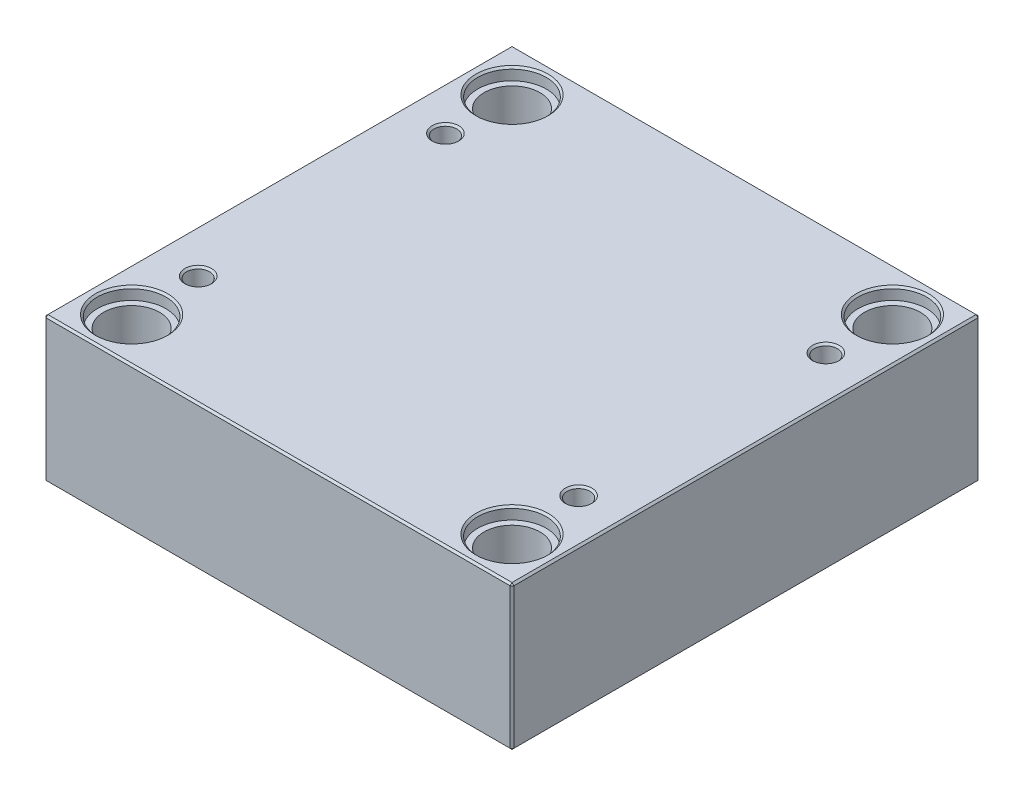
ISO-10303-21;
HEADER;
FILE_DESCRIPTION(('STEP AP214'),'2;1');
FILE_NAME('part.step','',(''),(''),'','','');
FILE_SCHEMA(('AUTOMOTIVE_DESIGN { 1 0 10303 214 1 1 1 1 }'));
ENDSEC;
DATA;
#1=APPLICATION_CONTEXT('core data for automotive mechanical design processes');
#2=APPLICATION_PROTOCOL_DEFINITION('international standard','automotive_design',2000,#1);
#3=PRODUCT_CONTEXT('',#1,'mechanical');
#4=PRODUCT('Part','Part','',(#3));
#5=PRODUCT_RELATED_PRODUCT_CATEGORY('part','',(#4));
#6=PRODUCT_DEFINITION_FORMATION('','',#4);
#7=PRODUCT_DEFINITION_CONTEXT('part definition',#1,'design');
#8=PRODUCT_DEFINITION('design','',#6,#7);
#9=PRODUCT_DEFINITION_SHAPE('','',#8);
#10=(LENGTH_UNIT() NAMED_UNIT(*) SI_UNIT(.MILLI.,.METRE.));
#11=(NAMED_UNIT(*) PLANE_ANGLE_UNIT() SI_UNIT($,.RADIAN.));
#12=(NAMED_UNIT(*) SI_UNIT($,.STERADIAN.) SOLID_ANGLE_UNIT());
#13=UNCERTAINTY_MEASURE_WITH_UNIT(LENGTH_MEASURE(1.E-05),#10,'distance_accuracy_value','');
#14=(GEOMETRIC_REPRESENTATION_CONTEXT(3) GLOBAL_UNCERTAINTY_ASSIGNED_CONTEXT((#13)) GLOBAL_UNIT_ASSIGNED_CONTEXT((#10,
#11,#12)) REPRESENTATION_CONTEXT('',''));
#15=CARTESIAN_POINT('',(0.,0.,0.));
#16=DIRECTION('',(0.,0.,1.));
#17=DIRECTION('',(1.,0.,0.));
#18=AXIS2_PLACEMENT_3D('',#15,#16,#17);
#19=CARTESIAN_POINT('',(-100.,0.,-100.));
#20=DIRECTION('',(0.,1.,0.));
#21=DIRECTION('',(0.,0.,1.));
#22=AXIS2_PLACEMENT_3D('',#19,#20,#21);
#23=CYLINDRICAL_SURFACE('',#22,14.7);
#24=CARTESIAN_POINT('',(-100.,0.999999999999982,-100.));
#25=DIRECTION('',(0.,1.,0.));
#26=DIRECTION('',(0.,0.,1.));
#27=AXIS2_PLACEMENT_3D('',#24,#25,#26);
#28=CIRCLE('',#27,14.7);
#29=CARTESIAN_POINT('',(-100.,0.999999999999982,-85.3));
#30=VERTEX_POINT('',#29);
#31=EDGE_CURVE('E472',#30,#30,#28,.F.);
#32=ORIENTED_EDGE('',*,*,#31,.T.);
#33=EDGE_LOOP('',(#32));
#34=FACE_BOUND('',#33,.T.);
#35=CARTESIAN_POINT('',(-100.,69.7,-100.));
#36=DIRECTION('',(0.,1.,0.));
#37=DIRECTION('',(0.,0.,1.));
#38=AXIS2_PLACEMENT_3D('',#35,#36,#37);
#39=CIRCLE('',#38,14.7);
#40=CARTESIAN_POINT('',(-100.,69.7,-85.3));
#41=VERTEX_POINT('',#40);
#42=EDGE_CURVE('E221',#41,#41,#39,.F.);
#43=ORIENTED_EDGE('',*,*,#42,.F.);
#44=EDGE_LOOP('',(#43));
#45=FACE_BOUND('',#44,.T.);
#46=ADVANCED_FACE('F16',(#34,#45),#23,.F.);
#47=CARTESIAN_POINT('',(100.,0.,-100.));
#48=DIRECTION('',(0.,1.,0.));
#49=DIRECTION('',(0.,0.,1.));
#50=AXIS2_PLACEMENT_3D('',#47,#48,#49);
#51=CYLINDRICAL_SURFACE('',#50,14.7);
#52=CARTESIAN_POINT('',(100.,0.999999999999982,-100.));
#53=DIRECTION('',(0.,1.,0.));
#54=DIRECTION('',(0.,0.,1.));
#55=AXIS2_PLACEMENT_3D('',#52,#53,#54);
#56=CIRCLE('',#55,14.7);
#57=CARTESIAN_POINT('',(100.,0.999999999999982,-85.3));
#58=VERTEX_POINT('',#57);
#59=EDGE_CURVE('E474',#58,#58,#56,.F.);
#60=ORIENTED_EDGE('',*,*,#59,.T.);
#61=EDGE_LOOP('',(#60));
#62=FACE_BOUND('',#61,.T.);
#63=CARTESIAN_POINT('',(100.,69.7,-100.));
#64=DIRECTION('',(0.,1.,0.));
#65=DIRECTION('',(0.,0.,1.));
#66=AXIS2_PLACEMENT_3D('',#63,#64,#65);
#67=CIRCLE('',#66,14.7);
#68=CARTESIAN_POINT('',(100.,69.7,-85.3));
#69=VERTEX_POINT('',#68);
#70=EDGE_CURVE('E218',#69,#69,#67,.F.);
#71=ORIENTED_EDGE('',*,*,#70,.F.);
#72=EDGE_LOOP('',(#71));
#73=FACE_BOUND('',#72,.T.);
#74=ADVANCED_FACE('F263',(#62,#73),#51,.F.);
#75=CARTESIAN_POINT('',(100.,0.,100.));
#76=DIRECTION('',(0.,1.,0.));
#77=DIRECTION('',(0.,0.,1.));
#78=AXIS2_PLACEMENT_3D('',#75,#76,#77);
#79=CYLINDRICAL_SURFACE('',#78,14.7);
#80=CARTESIAN_POINT('',(100.,1.00000000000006,100.));
#81=DIRECTION('',(0.,1.,0.));
#82=DIRECTION('',(0.,0.,1.));
#83=AXIS2_PLACEMENT_3D('',#80,#81,#82);
#84=CIRCLE('',#83,14.7);
#85=CARTESIAN_POINT('',(100.,1.00000000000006,114.7));
#86=VERTEX_POINT('',#85);
#87=EDGE_CURVE('E477',#86,#86,#84,.F.);
#88=ORIENTED_EDGE('',*,*,#87,.T.);
#89=EDGE_LOOP('',(#88));
#90=FACE_BOUND('',#89,.T.);
#91=CARTESIAN_POINT('',(100.,69.7,100.));
#92=DIRECTION('',(0.,1.,0.));
#93=DIRECTION('',(0.,0.,1.));
#94=AXIS2_PLACEMENT_3D('',#91,#92,#93);
#95=CIRCLE('',#94,14.7);
#96=CARTESIAN_POINT('',(100.,69.7,114.7));
#97=VERTEX_POINT('',#96);
#98=EDGE_CURVE('E214',#97,#97,#95,.F.);
#99=ORIENTED_EDGE('',*,*,#98,.F.);
#100=EDGE_LOOP('',(#99));
#101=FACE_BOUND('',#100,.T.);
#102=ADVANCED_FACE('F270',(#90,#101),#79,.F.);
#103=CARTESIAN_POINT('',(-100.,0.,100.));
#104=DIRECTION('',(0.,1.,0.));
#105=DIRECTION('',(0.,0.,1.));
#106=AXIS2_PLACEMENT_3D('',#103,#104,#105);
#107=CYLINDRICAL_SURFACE('',#106,14.7);
#108=CARTESIAN_POINT('',(-100.,0.999999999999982,100.));
#109=DIRECTION('',(0.,1.,0.));
#110=DIRECTION('',(0.,0.,1.));
#111=AXIS2_PLACEMENT_3D('',#108,#109,#110);
#112=CIRCLE('',#111,14.7);
#113=CARTESIAN_POINT('',(-100.,0.999999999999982,114.7));
#114=VERTEX_POINT('',#113);
#115=EDGE_CURVE('E480',#114,#114,#112,.F.);
#116=ORIENTED_EDGE('',*,*,#115,.T.);
#117=EDGE_LOOP('',(#116));
#118=FACE_BOUND('',#117,.T.);
#119=CARTESIAN_POINT('',(-100.,69.7,100.));
#120=DIRECTION('',(0.,1.,0.));
#121=DIRECTION('',(0.,0.,1.));
#122=AXIS2_PLACEMENT_3D('',#119,#120,#121);
#123=CIRCLE('',#122,14.7);
#124=CARTESIAN_POINT('',(-100.,69.7,114.7));
#125=VERTEX_POINT('',#124);
#126=EDGE_CURVE('E211',#125,#125,#123,.F.);
#127=ORIENTED_EDGE('',*,*,#126,.F.);
#128=EDGE_LOOP('',(#127));
#129=FACE_BOUND('',#128,.T.);
#130=ADVANCED_FACE('F277',(#118,#129),#107,.F.);
#131=CARTESIAN_POINT('',(-123.,76.,123.));
#132=DIRECTION('',(1.,0.,0.));
#133=DIRECTION('',(0.,0.,-1.));
#134=AXIS2_PLACEMENT_3D('',#131,#132,#133);
#135=PLANE('',#134);
#136=DIRECTION('',(0.,-1.,0.));
#137=VECTOR('',#136,1.);
#138=CARTESIAN_POINT('',(-123.,76.,-122.));
#139=LINE('',#138,#137);
#140=CARTESIAN_POINT('',(-123.,75.,-122.));
#141=VERTEX_POINT('',#140);
#142=CARTESIAN_POINT('',(-123.,1.00000000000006,-122.));
#143=VERTEX_POINT('',#142);
#144=EDGE_CURVE('E487',#141,#143,#139,.T.);
#145=ORIENTED_EDGE('',*,*,#144,.T.);
#146=DIRECTION('',(0.,0.,1.));
#147=VECTOR('',#146,1.);
#148=CARTESIAN_POINT('',(-123.,1.00000000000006,123.));
#149=LINE('',#148,#147);
#150=CARTESIAN_POINT('',(-123.,1.00000000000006,122.));
#151=VERTEX_POINT('',#150);
#152=EDGE_CURVE('E490',#143,#151,#149,.T.);
#153=ORIENTED_EDGE('',*,*,#152,.T.);
#154=DIRECTION('',(0.,1.,0.));
#155=VECTOR('',#154,1.);
#156=CARTESIAN_POINT('',(-123.,76.,122.));
#157=LINE('',#156,#155);
#158=CARTESIAN_POINT('',(-123.,75.,122.));
#159=VERTEX_POINT('',#158);
#160=EDGE_CURVE('E485',#151,#159,#157,.T.);
#161=ORIENTED_EDGE('',*,*,#160,.T.);
#162=DIRECTION('',(0.,0.,-1.));
#163=VECTOR('',#162,1.);
#164=CARTESIAN_POINT('',(-123.,75.,-123.));
#165=LINE('',#164,#163);
#166=EDGE_CURVE('E483',#159,#141,#165,.T.);
#167=ORIENTED_EDGE('',*,*,#166,.T.);
#168=EDGE_LOOP('',(#145,#153,#161,#167));
#169=FACE_BOUND('',#168,.T.);
#170=ADVANCED_FACE('F298',(#169),#135,.F.);
#171=CARTESIAN_POINT('',(123.,76.,123.));
#172=DIRECTION('',(0.,0.,-1.));
#173=DIRECTION('',(-1.,0.,0.));
#174=AXIS2_PLACEMENT_3D('',#171,#172,#173);
#175=PLANE('',#174);
#176=DIRECTION('',(-1.,0.,0.));
#177=VECTOR('',#176,1.);
#178=CARTESIAN_POINT('',(-123.,75.,123.));
#179=LINE('',#178,#177);
#180=CARTESIAN_POINT('',(122.,75.,123.));
#181=VERTEX_POINT('',#180);
#182=CARTESIAN_POINT('',(-122.,75.,123.));
#183=VERTEX_POINT('',#182);
#184=EDGE_CURVE('E509',#181,#183,#179,.T.);
#185=ORIENTED_EDGE('',*,*,#184,.T.);
#186=DIRECTION('',(0.,-1.,0.));
#187=VECTOR('',#186,1.);
#188=CARTESIAN_POINT('',(-122.,76.,123.));
#189=LINE('',#188,#187);
#190=CARTESIAN_POINT('',(-122.,1.,123.));
#191=VERTEX_POINT('',#190);
#192=EDGE_CURVE('E515',#183,#191,#189,.T.);
#193=ORIENTED_EDGE('',*,*,#192,.T.);
#194=DIRECTION('',(1.,0.,0.));
#195=VECTOR('',#194,1.);
#196=CARTESIAN_POINT('',(123.,1.,123.));
#197=LINE('',#196,#195);
#198=CARTESIAN_POINT('',(122.,1.,123.));
#199=VERTEX_POINT('',#198);
#200=EDGE_CURVE('E513',#191,#199,#197,.T.);
#201=ORIENTED_EDGE('',*,*,#200,.T.);
#202=DIRECTION('',(0.,1.,0.));
#203=VECTOR('',#202,1.);
#204=CARTESIAN_POINT('',(122.,76.,123.));
#205=LINE('',#204,#203);
#206=EDGE_CURVE('E511',#199,#181,#205,.T.);
#207=ORIENTED_EDGE('',*,*,#206,.T.);
#208=EDGE_LOOP('',(#185,#193,#201,#207));
#209=FACE_BOUND('',#208,.T.);
#210=ADVANCED_FACE('F294',(#209),#175,.F.);
#211=CARTESIAN_POINT('',(123.,76.,123.));
#212=DIRECTION('',(-1.,0.,0.));
#213=DIRECTION('',(0.,0.,1.));
#214=AXIS2_PLACEMENT_3D('',#211,#212,#213);
#215=PLANE('',#214);
#216=DIRECTION('',(0.,0.,-1.));
#217=VECTOR('',#216,1.);
#218=CARTESIAN_POINT('',(123.,1.,123.));
#219=LINE('',#218,#217);
#220=CARTESIAN_POINT('',(123.,1.,122.));
#221=VERTEX_POINT('',#220);
#222=CARTESIAN_POINT('',(123.,1.,-122.));
#223=VERTEX_POINT('',#222);
#224=EDGE_CURVE('E504',#221,#223,#219,.T.);
#225=ORIENTED_EDGE('',*,*,#224,.T.);
#226=DIRECTION('',(0.,1.,0.));
#227=VECTOR('',#226,1.);
#228=CARTESIAN_POINT('',(123.,76.,-122.));
#229=LINE('',#228,#227);
#230=CARTESIAN_POINT('',(123.,75.,-122.));
#231=VERTEX_POINT('',#230);
#232=EDGE_CURVE('E506',#223,#231,#229,.T.);
#233=ORIENTED_EDGE('',*,*,#232,.T.);
#234=DIRECTION('',(0.,0.,1.));
#235=VECTOR('',#234,1.);
#236=CARTESIAN_POINT('',(123.,75.,123.));
#237=LINE('',#236,#235);
#238=CARTESIAN_POINT('',(123.,75.,122.));
#239=VERTEX_POINT('',#238);
#240=EDGE_CURVE('E500',#231,#239,#237,.T.);
#241=ORIENTED_EDGE('',*,*,#240,.T.);
#242=DIRECTION('',(0.,-1.,0.));
#243=VECTOR('',#242,1.);
#244=CARTESIAN_POINT('',(123.,76.,122.));
#245=LINE('',#244,#243);
#246=EDGE_CURVE('E502',#239,#221,#245,.T.);
#247=ORIENTED_EDGE('',*,*,#246,.T.);
#248=EDGE_LOOP('',(#225,#233,#241,#247));
#249=FACE_BOUND('',#248,.T.);
#250=ADVANCED_FACE('F290',(#249),#215,.F.);
#251=CARTESIAN_POINT('',(123.,76.,-123.));
#252=DIRECTION('',(0.,0.,1.));
#253=DIRECTION('',(1.,0.,0.));
#254=AXIS2_PLACEMENT_3D('',#251,#252,#253);
#255=PLANE('',#254);
#256=DIRECTION('',(0.,-1.,0.));
#257=VECTOR('',#256,1.);
#258=CARTESIAN_POINT('',(122.,76.,-123.));
#259=LINE('',#258,#257);
#260=CARTESIAN_POINT('',(122.,75.,-123.));
#261=VERTEX_POINT('',#260);
#262=CARTESIAN_POINT('',(122.,1.,-123.));
#263=VERTEX_POINT('',#262);
#264=EDGE_CURVE('E494',#261,#263,#259,.T.);
#265=ORIENTED_EDGE('',*,*,#264,.T.);
#266=DIRECTION('',(-1.,0.,0.));
#267=VECTOR('',#266,1.);
#268=CARTESIAN_POINT('',(123.,1.,-123.));
#269=LINE('',#268,#267);
#270=CARTESIAN_POINT('',(-122.,1.,-123.));
#271=VERTEX_POINT('',#270);
#272=EDGE_CURVE('E138',#263,#271,#269,.T.);
#273=ORIENTED_EDGE('',*,*,#272,.T.);
#274=DIRECTION('',(0.,1.,0.));
#275=VECTOR('',#274,1.);
#276=CARTESIAN_POINT('',(-122.,76.,-123.));
#277=LINE('',#276,#275);
#278=CARTESIAN_POINT('',(-122.,75.,-123.));
#279=VERTEX_POINT('',#278);
#280=EDGE_CURVE('E496',#271,#279,#277,.T.);
#281=ORIENTED_EDGE('',*,*,#280,.T.);
#282=DIRECTION('',(1.,0.,0.));
#283=VECTOR('',#282,1.);
#284=CARTESIAN_POINT('',(123.,75.,-123.));
#285=LINE('',#284,#283);
#286=EDGE_CURVE('E492',#279,#261,#285,.T.);
#287=ORIENTED_EDGE('',*,*,#286,.T.);
#288=EDGE_LOOP('',(#265,#273,#281,#287));
#289=FACE_BOUND('',#288,.T.);
#290=ADVANCED_FACE('F282',(#289),#255,.F.);
#291=CARTESIAN_POINT('',(0.,76.,0.));
#292=DIRECTION('',(0.,1.,0.));
#293=DIRECTION('',(0.,0.,1.));
#294=AXIS2_PLACEMENT_3D('',#291,#292,#293);
#295=PLANE('',#294);
#296=CARTESIAN_POINT('',(100.,76.,100.));
#297=DIRECTION('',(0.,1.,0.));
#298=DIRECTION('',(0.,0.,1.));
#299=AXIS2_PLACEMENT_3D('',#296,#297,#298);
#300=CIRCLE('',#299,19.);
#301=CARTESIAN_POINT('',(100.,76.,119.));
#302=VERTEX_POINT('',#301);
#303=EDGE_CURVE('E236',#302,#302,#300,.F.);
#304=ORIENTED_EDGE('',*,*,#303,.T.);
#305=EDGE_LOOP('',(#304));
#306=FACE_BOUND('',#305,.T.);
#307=CARTESIAN_POINT('',(-100.,76.,100.));
#308=DIRECTION('',(0.,1.,0.));
#309=DIRECTION('',(0.,0.,1.));
#310=AXIS2_PLACEMENT_3D('',#307,#308,#309);
#311=CIRCLE('',#310,19.);
#312=CARTESIAN_POINT('',(-100.,76.,119.));
#313=VERTEX_POINT('',#312);
#314=EDGE_CURVE('E233',#313,#313,#311,.F.);
#315=ORIENTED_EDGE('',*,*,#314,.T.);
#316=EDGE_LOOP('',(#315));
#317=FACE_BOUND('',#316,.T.);
#318=CARTESIAN_POINT('',(100.,76.,-100.));
#319=DIRECTION('',(0.,1.,0.));
#320=DIRECTION('',(0.,0.,1.));
#321=AXIS2_PLACEMENT_3D('',#318,#319,#320);
#322=CIRCLE('',#321,19.);
#323=CARTESIAN_POINT('',(100.,76.,-81.));
#324=VERTEX_POINT('',#323);
#325=EDGE_CURVE('E230',#324,#324,#322,.F.);
#326=ORIENTED_EDGE('',*,*,#325,.T.);
#327=EDGE_LOOP('',(#326));
#328=FACE_BOUND('',#327,.T.);
#329=CARTESIAN_POINT('',(-100.,76.,-100.));
#330=DIRECTION('',(0.,1.,0.));
#331=DIRECTION('',(0.,0.,1.));
#332=AXIS2_PLACEMENT_3D('',#329,#330,#331);
#333=CIRCLE('',#332,19.);
#334=CARTESIAN_POINT('',(-100.,76.,-81.));
#335=VERTEX_POINT('',#334);
#336=EDGE_CURVE('E227',#335,#335,#333,.F.);
#337=ORIENTED_EDGE('',*,*,#336,.T.);
#338=EDGE_LOOP('',(#337));
#339=FACE_BOUND('',#338,.T.);
#340=CARTESIAN_POINT('',(-100.,76.,65.));
#341=DIRECTION('',(0.,1.,0.));
#342=DIRECTION('',(0.,0.,1.));
#343=AXIS2_PLACEMENT_3D('',#340,#341,#342);
#344=CIRCLE('',#343,7.);
#345=CARTESIAN_POINT('',(-100.,76.,72.));
#346=VERTEX_POINT('',#345);
#347=EDGE_CURVE('E198',#346,#346,#344,.F.);
#348=ORIENTED_EDGE('',*,*,#347,.T.);
#349=EDGE_LOOP('',(#348));
#350=FACE_BOUND('',#349,.T.);
#351=CARTESIAN_POINT('',(100.,76.,65.));
#352=DIRECTION('',(0.,1.,0.));
#353=DIRECTION('',(0.,0.,1.));
#354=AXIS2_PLACEMENT_3D('',#351,#352,#353);
#355=CIRCLE('',#354,7.);
#356=CARTESIAN_POINT('',(100.,76.,72.));
#357=VERTEX_POINT('',#356);
#358=EDGE_CURVE('E195',#357,#357,#355,.F.);
#359=ORIENTED_EDGE('',*,*,#358,.T.);
#360=EDGE_LOOP('',(#359));
#361=FACE_BOUND('',#360,.T.);
#362=CARTESIAN_POINT('',(100.,76.,-65.));
#363=DIRECTION('',(0.,1.,0.));
#364=DIRECTION('',(0.,0.,1.));
#365=AXIS2_PLACEMENT_3D('',#362,#363,#364);
#366=CIRCLE('',#365,7.);
#367=CARTESIAN_POINT('',(100.,76.,-58.));
#368=VERTEX_POINT('',#367);
#369=EDGE_CURVE('E192',#368,#368,#366,.F.);
#370=ORIENTED_EDGE('',*,*,#369,.T.);
#371=EDGE_LOOP('',(#370));
#372=FACE_BOUND('',#371,.T.);
#373=CARTESIAN_POINT('',(-100.,76.,-65.));
#374=DIRECTION('',(0.,1.,0.));
#375=DIRECTION('',(0.,0.,1.));
#376=AXIS2_PLACEMENT_3D('',#373,#374,#375);
#377=CIRCLE('',#376,7.00000000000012);
#378=CARTESIAN_POINT('',(-100.,76.,-57.9999999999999));
#379=VERTEX_POINT('',#378);
#380=EDGE_CURVE('E188',#379,#379,#377,.F.);
#381=ORIENTED_EDGE('',*,*,#380,.T.);
#382=EDGE_LOOP('',(#381));
#383=FACE_BOUND('',#382,.T.);
#384=DIRECTION('',(0.,0.,-1.));
#385=VECTOR('',#384,1.);
#386=CARTESIAN_POINT('',(122.,76.,-123.));
#387=LINE('',#386,#385);
#388=CARTESIAN_POINT('',(122.,76.,122.));
#389=VERTEX_POINT('',#388);
#390=CARTESIAN_POINT('',(122.,76.,-122.));
#391=VERTEX_POINT('',#390);
#392=EDGE_CURVE('E31',#389,#391,#387,.T.);
#393=ORIENTED_EDGE('',*,*,#392,.T.);
#394=DIRECTION('',(-1.,0.,0.));
#395=VECTOR('',#394,1.);
#396=CARTESIAN_POINT('',(-123.,76.,-122.));
#397=LINE('',#396,#395);
#398=CARTESIAN_POINT('',(-122.,76.,-122.));
#399=VERTEX_POINT('',#398);
#400=EDGE_CURVE('E189',#391,#399,#397,.T.);
#401=ORIENTED_EDGE('',*,*,#400,.T.);
#402=DIRECTION('',(0.,0.,1.));
#403=VECTOR('',#402,1.);
#404=CARTESIAN_POINT('',(-122.,76.,123.));
#405=LINE('',#404,#403);
#406=CARTESIAN_POINT('',(-122.,76.,122.));
#407=VERTEX_POINT('',#406);
#408=EDGE_CURVE('E518',#399,#407,#405,.T.);
#409=ORIENTED_EDGE('',*,*,#408,.T.);
#410=DIRECTION('',(1.,0.,0.));
#411=VECTOR('',#410,1.);
#412=CARTESIAN_POINT('',(123.,76.,122.));
#413=LINE('',#412,#411);
#414=EDGE_CURVE('E36',#407,#389,#413,.T.);
#415=ORIENTED_EDGE('',*,*,#414,.T.);
#416=EDGE_LOOP('',(#393,#401,#409,#415));
#417=FACE_BOUND('',#416,.T.);
#418=ADVANCED_FACE('F279',(#306,#317,#328,#339,#350,#361,#372,#383,#417),#295,.T.);
#419=CARTESIAN_POINT('',(0.,0.,0.));
#420=DIRECTION('',(0.,1.,0.));
#421=DIRECTION('',(0.,0.,1.));
#422=AXIS2_PLACEMENT_3D('',#419,#420,#421);
#423=PLANE('',#422);
#424=CARTESIAN_POINT('',(-100.,0.,-100.));
#425=DIRECTION('',(0.,1.,0.));
#426=DIRECTION('',(0.,0.,1.));
#427=AXIS2_PLACEMENT_3D('',#424,#425,#426);
#428=CIRCLE('',#427,15.7);
#429=CARTESIAN_POINT('',(-100.,0.,-84.3));
#430=VERTEX_POINT('',#429);
#431=EDGE_CURVE('E469',#430,#430,#428,.T.);
#432=ORIENTED_EDGE('',*,*,#431,.T.);
#433=EDGE_LOOP('',(#432));
#434=FACE_BOUND('',#433,.T.);
#435=CARTESIAN_POINT('',(100.,0.,-100.));
#436=DIRECTION('',(0.,1.,0.));
#437=DIRECTION('',(0.,0.,1.));
#438=AXIS2_PLACEMENT_3D('',#435,#436,#437);
#439=CIRCLE('',#438,15.7);
#440=CARTESIAN_POINT('',(100.,0.,-84.3));
#441=VERTEX_POINT('',#440);
#442=EDGE_CURVE('E466',#441,#441,#439,.T.);
#443=ORIENTED_EDGE('',*,*,#442,.T.);
#444=EDGE_LOOP('',(#443));
#445=FACE_BOUND('',#444,.T.);
#446=CARTESIAN_POINT('',(100.,0.,100.));
#447=DIRECTION('',(0.,1.,0.));
#448=DIRECTION('',(0.,0.,1.));
#449=AXIS2_PLACEMENT_3D('',#446,#447,#448);
#450=CIRCLE('',#449,15.7);
#451=CARTESIAN_POINT('',(100.,0.,115.7));
#452=VERTEX_POINT('',#451);
#453=EDGE_CURVE('E463',#452,#452,#450,.T.);
#454=ORIENTED_EDGE('',*,*,#453,.T.);
#455=EDGE_LOOP('',(#454));
#456=FACE_BOUND('',#455,.T.);
#457=CARTESIAN_POINT('',(-100.,0.,100.));
#458=DIRECTION('',(0.,1.,0.));
#459=DIRECTION('',(0.,0.,1.));
#460=AXIS2_PLACEMENT_3D('',#457,#458,#459);
#461=CIRCLE('',#460,15.7);
#462=CARTESIAN_POINT('',(-100.,0.,115.7));
#463=VERTEX_POINT('',#462);
#464=EDGE_CURVE('E460',#463,#463,#461,.T.);
#465=ORIENTED_EDGE('',*,*,#464,.T.);
#466=EDGE_LOOP('',(#465));
#467=FACE_BOUND('',#466,.T.);
#468=DIRECTION('',(0.,0.,1.));
#469=VECTOR('',#468,1.);
#470=CARTESIAN_POINT('',(122.,0.,0.));
#471=LINE('',#470,#469);
#472=CARTESIAN_POINT('',(122.,0.,-122.));
#473=VERTEX_POINT('',#472);
#474=CARTESIAN_POINT('',(122.,0.,122.));
#475=VERTEX_POINT('',#474);
#476=EDGE_CURVE('E108',#473,#475,#471,.T.);
#477=ORIENTED_EDGE('',*,*,#476,.T.);
#478=DIRECTION('',(-1.,0.,0.));
#479=VECTOR('',#478,1.);
#480=CARTESIAN_POINT('',(0.,0.,122.));
#481=LINE('',#480,#479);
#482=CARTESIAN_POINT('',(-122.,0.,122.));
#483=VERTEX_POINT('',#482);
#484=EDGE_CURVE('E458',#475,#483,#481,.T.);
#485=ORIENTED_EDGE('',*,*,#484,.T.);
#486=DIRECTION('',(0.,0.,-1.));
#487=VECTOR('',#486,1.);
#488=CARTESIAN_POINT('',(-122.,0.,0.));
#489=LINE('',#488,#487);
#490=CARTESIAN_POINT('',(-122.,0.,-122.));
#491=VERTEX_POINT('',#490);
#492=EDGE_CURVE('E110',#483,#491,#489,.T.);
#493=ORIENTED_EDGE('',*,*,#492,.T.);
#494=DIRECTION('',(1.,0.,0.));
#495=VECTOR('',#494,1.);
#496=CARTESIAN_POINT('',(0.,0.,-122.));
#497=LINE('',#496,#495);
#498=EDGE_CURVE('E104',#491,#473,#497,.T.);
#499=ORIENTED_EDGE('',*,*,#498,.T.);
#500=EDGE_LOOP('',(#477,#485,#493,#499));
#501=FACE_BOUND('',#500,.T.);
#502=ADVANCED_FACE('F106',(#434,#445,#456,#467,#501),#423,.F.);
#503=CARTESIAN_POINT('',(-100.,0.,-100.));
#504=DIRECTION('',(0.,-1.,0.));
#505=DIRECTION('',(0.,0.,-1.));
#506=AXIS2_PLACEMENT_3D('',#503,#504,#505);
#507=CONICAL_SURFACE('',#506,15.7,0.785398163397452);
#508=ORIENTED_EDGE('',*,*,#31,.F.);
#509=EDGE_LOOP('',(#508));
#510=FACE_BOUND('',#509,.T.);
#511=ORIENTED_EDGE('',*,*,#431,.F.);
#512=EDGE_LOOP('',(#511));
#513=FACE_BOUND('',#512,.T.);
#514=ADVANCED_FACE('F286',(#510,#513),#507,.F.);
#515=CARTESIAN_POINT('',(100.,0.,-100.));
#516=DIRECTION('',(0.,-1.,0.));
#517=DIRECTION('',(0.,0.,-1.));
#518=AXIS2_PLACEMENT_3D('',#515,#516,#517);
#519=CONICAL_SURFACE('',#518,15.7,0.785398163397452);
#520=ORIENTED_EDGE('',*,*,#59,.F.);
#521=EDGE_LOOP('',(#520));
#522=FACE_BOUND('',#521,.T.);
#523=ORIENTED_EDGE('',*,*,#442,.F.);
#524=EDGE_LOOP('',(#523));
#525=FACE_BOUND('',#524,.T.);
#526=ADVANCED_FACE('F305',(#522,#525),#519,.F.);
#527=CARTESIAN_POINT('',(100.,0.,100.));
#528=DIRECTION('',(0.,-1.,0.));
#529=DIRECTION('',(0.,0.,-1.));
#530=AXIS2_PLACEMENT_3D('',#527,#528,#529);
#531=CONICAL_SURFACE('',#530,15.7,0.785398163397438);
#532=ORIENTED_EDGE('',*,*,#87,.F.);
#533=EDGE_LOOP('',(#532));
#534=FACE_BOUND('',#533,.T.);
#535=ORIENTED_EDGE('',*,*,#453,.F.);
#536=EDGE_LOOP('',(#535));
#537=FACE_BOUND('',#536,.T.);
#538=ADVANCED_FACE('F309',(#534,#537),#531,.F.);
#539=CARTESIAN_POINT('',(-100.,0.,100.));
#540=DIRECTION('',(0.,-1.,0.));
#541=DIRECTION('',(0.,0.,-1.));
#542=AXIS2_PLACEMENT_3D('',#539,#540,#541);
#543=CONICAL_SURFACE('',#542,15.7,0.785398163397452);
#544=ORIENTED_EDGE('',*,*,#115,.F.);
#545=EDGE_LOOP('',(#544));
#546=FACE_BOUND('',#545,.T.);
#547=ORIENTED_EDGE('',*,*,#464,.F.);
#548=EDGE_LOOP('',(#547));
#549=FACE_BOUND('',#548,.T.);
#550=ADVANCED_FACE('F313',(#546,#549),#543,.F.);
#551=CARTESIAN_POINT('',(123.,76.,122.));
#552=DIRECTION('',(-0.707106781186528,0.,-0.707106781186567));
#553=DIRECTION('',(0.,-1.,0.));
#554=AXIS2_PLACEMENT_3D('',#551,#552,#553);
#555=PLANE('',#554);
#556=DIRECTION('',(-0.707106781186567,0.,0.707106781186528));
#557=VECTOR('',#556,1.);
#558=CARTESIAN_POINT('',(122.,75.,123.));
#559=LINE('',#558,#557);
#560=EDGE_CURVE('E126',#181,#239,#559,.F.);
#561=ORIENTED_EDGE('',*,*,#560,.F.);
#562=ORIENTED_EDGE('',*,*,#206,.F.);
#563=DIRECTION('',(0.707106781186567,0.,-0.707106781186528));
#564=VECTOR('',#563,1.);
#565=CARTESIAN_POINT('',(122.,1.,123.));
#566=LINE('',#565,#564);
#567=EDGE_CURVE('E180',#221,#199,#566,.F.);
#568=ORIENTED_EDGE('',*,*,#567,.F.);
#569=ORIENTED_EDGE('',*,*,#246,.F.);
#570=EDGE_LOOP('',(#561,#562,#568,#569));
#571=FACE_BOUND('',#570,.T.);
#572=ADVANCED_FACE('F317',(#571),#555,.F.);
#573=CARTESIAN_POINT('',(122.,75.,123.));
#574=DIRECTION('',(0.577350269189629,0.577350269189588,0.577350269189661));
#575=DIRECTION('',(0.707106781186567,0.,-0.707106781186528));
#576=AXIS2_PLACEMENT_3D('',#573,#574,#575);
#577=PLANE('',#576);
#578=DIRECTION('',(0.,-0.70710678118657,0.707106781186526));
#579=VECTOR('',#578,1.);
#580=CARTESIAN_POINT('',(122.,75.,123.));
#581=LINE('',#580,#579);
#582=EDGE_CURVE('E175',#181,#389,#581,.F.);
#583=ORIENTED_EDGE('',*,*,#582,.F.);
#584=ORIENTED_EDGE('',*,*,#560,.T.);
#585=DIRECTION('',(-0.707106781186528,0.707106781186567,0.));
#586=VECTOR('',#585,1.);
#587=CARTESIAN_POINT('',(122.5,75.5,122.));
#588=LINE('',#587,#586);
#589=EDGE_CURVE('E177',#389,#239,#588,.F.);
#590=ORIENTED_EDGE('',*,*,#589,.F.);
#591=EDGE_LOOP('',(#583,#584,#590));
#592=FACE_BOUND('',#591,.T.);
#593=ADVANCED_FACE('F385',(#592),#577,.T.);
#594=CARTESIAN_POINT('',(122.,1.,123.));
#595=DIRECTION('',(0.577350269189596,-0.577350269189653,0.577350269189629));
#596=DIRECTION('',(0.,-0.707106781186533,-0.707106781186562));
#597=AXIS2_PLACEMENT_3D('',#594,#595,#596);
#598=PLANE('',#597);
#599=DIRECTION('',(-0.707106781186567,-0.707106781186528,0.));
#600=VECTOR('',#599,1.);
#601=CARTESIAN_POINT('',(122.5,0.499999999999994,122.));
#602=LINE('',#601,#600);
#603=EDGE_CURVE('E124',#221,#475,#602,.T.);
#604=ORIENTED_EDGE('',*,*,#603,.F.);
#605=ORIENTED_EDGE('',*,*,#567,.T.);
#606=DIRECTION('',(0.,0.70710678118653,0.707106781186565));
#607=VECTOR('',#606,1.);
#608=CARTESIAN_POINT('',(122.,1.,123.));
#609=LINE('',#608,#607);
#610=EDGE_CURVE('E172',#475,#199,#609,.T.);
#611=ORIENTED_EDGE('',*,*,#610,.F.);
#612=EDGE_LOOP('',(#604,#605,#611));
#613=FACE_BOUND('',#612,.T.);
#614=ADVANCED_FACE('F381',(#613),#598,.T.);
#615=CARTESIAN_POINT('',(122.,76.,0.));
#616=DIRECTION('',(0.707106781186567,0.707106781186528,0.));
#617=DIRECTION('',(0.,0.,1.));
#618=AXIS2_PLACEMENT_3D('',#615,#616,#617);
#619=PLANE('',#618);
#620=ORIENTED_EDGE('',*,*,#589,.T.);
#621=ORIENTED_EDGE('',*,*,#240,.F.);
#622=DIRECTION('',(0.707106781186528,-0.707106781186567,0.));
#623=VECTOR('',#622,1.);
#624=CARTESIAN_POINT('',(123.,75.,-122.));
#625=LINE('',#624,#623);
#626=EDGE_CURVE('E166',#391,#231,#625,.T.);
#627=ORIENTED_EDGE('',*,*,#626,.F.);
#628=ORIENTED_EDGE('',*,*,#392,.F.);
#629=EDGE_LOOP('',(#620,#621,#627,#628));
#630=FACE_BOUND('',#629,.T.);
#631=ADVANCED_FACE('F377',(#630),#619,.T.);
#632=CARTESIAN_POINT('',(0.,76.,122.));
#633=DIRECTION('',(0.,0.707106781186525,0.70710678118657));
#634=DIRECTION('',(-1.,0.,0.));
#635=AXIS2_PLACEMENT_3D('',#632,#633,#634);
#636=PLANE('',#635);
#637=ORIENTED_EDGE('',*,*,#582,.T.);
#638=ORIENTED_EDGE('',*,*,#414,.F.);
#639=DIRECTION('',(0.,0.707106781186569,-0.707106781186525));
#640=VECTOR('',#639,1.);
#641=CARTESIAN_POINT('',(-122.,75.5,122.5));
#642=LINE('',#641,#640);
#643=EDGE_CURVE('E163',#183,#407,#642,.T.);
#644=ORIENTED_EDGE('',*,*,#643,.F.);
#645=ORIENTED_EDGE('',*,*,#184,.F.);
#646=EDGE_LOOP('',(#637,#638,#644,#645));
#647=FACE_BOUND('',#646,.T.);
#648=ADVANCED_FACE('F373',(#647),#636,.T.);
#649=CARTESIAN_POINT('',(-122.,76.,123.));
#650=DIRECTION('',(0.707106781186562,0.,-0.707106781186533));
#651=DIRECTION('',(0.,-1.,0.));
#652=AXIS2_PLACEMENT_3D('',#649,#650,#651);
#653=PLANE('',#652);
#654=DIRECTION('',(0.707106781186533,0.,0.707106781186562));
#655=VECTOR('',#654,1.);
#656=CARTESIAN_POINT('',(-122.,1.,123.));
#657=LINE('',#656,#655);
#658=EDGE_CURVE('E157',#191,#151,#657,.F.);
#659=ORIENTED_EDGE('',*,*,#658,.F.);
#660=ORIENTED_EDGE('',*,*,#192,.F.);
#661=DIRECTION('',(-0.707106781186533,0.,-0.707106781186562));
#662=VECTOR('',#661,1.);
#663=CARTESIAN_POINT('',(-123.,75.,122.));
#664=LINE('',#663,#662);
#665=EDGE_CURVE('E160',#159,#183,#664,.F.);
#666=ORIENTED_EDGE('',*,*,#665,.F.);
#667=ORIENTED_EDGE('',*,*,#160,.F.);
#668=EDGE_LOOP('',(#659,#660,#666,#667));
#669=FACE_BOUND('',#668,.T.);
#670=ADVANCED_FACE('F369',(#669),#653,.F.);
#671=CARTESIAN_POINT('',(123.,1.,123.));
#672=DIRECTION('',(0.,0.707106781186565,-0.70710678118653));
#673=DIRECTION('',(1.,0.,0.));
#674=AXIS2_PLACEMENT_3D('',#671,#672,#673);
#675=PLANE('',#674);
#676=ORIENTED_EDGE('',*,*,#610,.T.);
#677=ORIENTED_EDGE('',*,*,#200,.F.);
#678=DIRECTION('',(0.,-0.70710678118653,-0.707106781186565));
#679=VECTOR('',#678,1.);
#680=CARTESIAN_POINT('',(-122.,1.,123.));
#681=LINE('',#680,#679);
#682=EDGE_CURVE('E135',#483,#191,#681,.F.);
#683=ORIENTED_EDGE('',*,*,#682,.F.);
#684=ORIENTED_EDGE('',*,*,#484,.F.);
#685=EDGE_LOOP('',(#676,#677,#683,#684));
#686=FACE_BOUND('',#685,.T.);
#687=ADVANCED_FACE('F366',(#686),#675,.F.);
#688=CARTESIAN_POINT('',(123.,1.,123.));
#689=DIRECTION('',(-0.707106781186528,0.707106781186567,0.));
#690=DIRECTION('',(0.,0.,-1.));
#691=AXIS2_PLACEMENT_3D('',#688,#689,#690);
#692=PLANE('',#691);
#693=ORIENTED_EDGE('',*,*,#603,.T.);
#694=ORIENTED_EDGE('',*,*,#476,.F.);
#695=DIRECTION('',(0.707106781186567,0.707106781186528,0.));
#696=VECTOR('',#695,1.);
#697=CARTESIAN_POINT('',(122.5,0.500000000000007,-122.));
#698=LINE('',#697,#696);
#699=EDGE_CURVE('E121',#223,#473,#698,.F.);
#700=ORIENTED_EDGE('',*,*,#699,.F.);
#701=ORIENTED_EDGE('',*,*,#224,.F.);
#702=EDGE_LOOP('',(#693,#694,#700,#701));
#703=FACE_BOUND('',#702,.T.);
#704=ADVANCED_FACE('F119',(#703),#692,.F.);
#705=CARTESIAN_POINT('',(122.,76.,-123.));
#706=DIRECTION('',(-0.707106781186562,0.,0.707106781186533));
#707=DIRECTION('',(0.,-1.,0.));
#708=AXIS2_PLACEMENT_3D('',#705,#706,#707);
#709=PLANE('',#708);
#710=DIRECTION('',(0.707106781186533,0.,0.707106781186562));
#711=VECTOR('',#710,1.);
#712=CARTESIAN_POINT('',(123.,75.,-122.));
#713=LINE('',#712,#711);
#714=EDGE_CURVE('E168',#231,#261,#713,.F.);
#715=ORIENTED_EDGE('',*,*,#714,.F.);
#716=ORIENTED_EDGE('',*,*,#232,.F.);
#717=DIRECTION('',(-0.707106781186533,0.,-0.707106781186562));
#718=VECTOR('',#717,1.);
#719=CARTESIAN_POINT('',(122.,1.,-123.));
#720=LINE('',#719,#718);
#721=EDGE_CURVE('E134',#263,#223,#720,.F.);
#722=ORIENTED_EDGE('',*,*,#721,.F.);
#723=ORIENTED_EDGE('',*,*,#264,.F.);
#724=EDGE_LOOP('',(#715,#716,#722,#723));
#725=FACE_BOUND('',#724,.T.);
#726=ADVANCED_FACE('F359',(#725),#709,.F.);
#727=CARTESIAN_POINT('',(123.,75.,-122.));
#728=DIRECTION('',(0.577350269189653,0.577350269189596,-0.577350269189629));
#729=DIRECTION('',(-0.707106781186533,0.,-0.707106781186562));
#730=AXIS2_PLACEMENT_3D('',#727,#728,#729);
#731=PLANE('',#730);
#732=ORIENTED_EDGE('',*,*,#626,.T.);
#733=ORIENTED_EDGE('',*,*,#714,.T.);
#734=DIRECTION('',(0.,0.707106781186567,0.707106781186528));
#735=VECTOR('',#734,1.);
#736=CARTESIAN_POINT('',(122.,75.5,-122.5));
#737=LINE('',#736,#735);
#738=EDGE_CURVE('E152',#391,#261,#737,.F.);
#739=ORIENTED_EDGE('',*,*,#738,.F.);
#740=EDGE_LOOP('',(#732,#733,#739));
#741=FACE_BOUND('',#740,.T.);
#742=ADVANCED_FACE('F355',(#741),#731,.T.);
#743=CARTESIAN_POINT('',(-123.,75.,122.));
#744=DIRECTION('',(-0.577350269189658,0.577350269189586,0.577350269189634));
#745=DIRECTION('',(0.707106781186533,0.,0.707106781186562));
#746=AXIS2_PLACEMENT_3D('',#743,#744,#745);
#747=PLANE('',#746);
#748=ORIENTED_EDGE('',*,*,#665,.T.);
#749=ORIENTED_EDGE('',*,*,#643,.T.);
#750=DIRECTION('',(-0.707106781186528,-0.707106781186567,0.));
#751=VECTOR('',#750,1.);
#752=CARTESIAN_POINT('',(-123.,75.,122.));
#753=LINE('',#752,#751);
#754=EDGE_CURVE('E143',#159,#407,#753,.F.);
#755=ORIENTED_EDGE('',*,*,#754,.F.);
#756=EDGE_LOOP('',(#748,#749,#755));
#757=FACE_BOUND('',#756,.T.);
#758=ADVANCED_FACE('F351',(#757),#747,.T.);
#759=CARTESIAN_POINT('',(-122.,1.,123.));
#760=DIRECTION('',(-0.577350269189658,-0.577350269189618,0.577350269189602));
#761=DIRECTION('',(0.707106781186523,-0.707106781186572,0.));
#762=AXIS2_PLACEMENT_3D('',#759,#760,#761);
#763=PLANE('',#762);
#764=ORIENTED_EDGE('',*,*,#682,.T.);
#765=ORIENTED_EDGE('',*,*,#658,.T.);
#766=DIRECTION('',(-0.707106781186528,0.707106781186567,0.));
#767=VECTOR('',#766,1.);
#768=CARTESIAN_POINT('',(-122.5,0.500000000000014,122.));
#769=LINE('',#768,#767);
#770=EDGE_CURVE('E139',#483,#151,#769,.T.);
#771=ORIENTED_EDGE('',*,*,#770,.F.);
#772=EDGE_LOOP('',(#764,#765,#771));
#773=FACE_BOUND('',#772,.T.);
#774=ADVANCED_FACE('F348',(#773),#763,.T.);
#775=CARTESIAN_POINT('',(122.,1.,-123.));
#776=DIRECTION('',(0.57735026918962,-0.577350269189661,-0.577350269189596));
#777=DIRECTION('',(0.707106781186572,0.707106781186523,0.));
#778=AXIS2_PLACEMENT_3D('',#775,#776,#777);
#779=PLANE('',#778);
#780=ORIENTED_EDGE('',*,*,#721,.T.);
#781=ORIENTED_EDGE('',*,*,#699,.T.);
#782=DIRECTION('',(0.,-0.707106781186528,0.707106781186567));
#783=VECTOR('',#782,1.);
#784=CARTESIAN_POINT('',(122.,1.,-123.));
#785=LINE('',#784,#783);
#786=EDGE_CURVE('E131',#263,#473,#785,.T.);
#787=ORIENTED_EDGE('',*,*,#786,.F.);
#788=EDGE_LOOP('',(#780,#781,#787));
#789=FACE_BOUND('',#788,.T.);
#790=ADVANCED_FACE('F130',(#789),#779,.T.);
#791=CARTESIAN_POINT('',(0.,76.,-122.));
#792=DIRECTION('',(0.,0.707106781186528,-0.707106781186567));
#793=DIRECTION('',(1.,0.,0.));
#794=AXIS2_PLACEMENT_3D('',#791,#792,#793);
#795=PLANE('',#794);
#796=ORIENTED_EDGE('',*,*,#738,.T.);
#797=ORIENTED_EDGE('',*,*,#286,.F.);
#798=DIRECTION('',(0.,-0.707106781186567,-0.707106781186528));
#799=VECTOR('',#798,1.);
#800=CARTESIAN_POINT('',(-122.,75.,-123.));
#801=LINE('',#800,#799);
#802=EDGE_CURVE('E140',#399,#279,#801,.T.);
#803=ORIENTED_EDGE('',*,*,#802,.F.);
#804=ORIENTED_EDGE('',*,*,#400,.F.);
#805=EDGE_LOOP('',(#796,#797,#803,#804));
#806=FACE_BOUND('',#805,.T.);
#807=ADVANCED_FACE('F341',(#806),#795,.T.);
#808=CARTESIAN_POINT('',(-122.,76.,0.));
#809=DIRECTION('',(-0.707106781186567,0.707106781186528,0.));
#810=DIRECTION('',(0.,0.,-1.));
#811=AXIS2_PLACEMENT_3D('',#808,#809,#810);
#812=PLANE('',#811);
#813=ORIENTED_EDGE('',*,*,#754,.T.);
#814=ORIENTED_EDGE('',*,*,#408,.F.);
#815=DIRECTION('',(0.707106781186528,0.707106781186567,0.));
#816=VECTOR('',#815,1.);
#817=CARTESIAN_POINT('',(-122.5,75.5,-122.));
#818=LINE('',#817,#816);
#819=EDGE_CURVE('E146',#141,#399,#818,.T.);
#820=ORIENTED_EDGE('',*,*,#819,.F.);
#821=ORIENTED_EDGE('',*,*,#166,.F.);
#822=EDGE_LOOP('',(#813,#814,#820,#821));
#823=FACE_BOUND('',#822,.T.);
#824=ADVANCED_FACE('F337',(#823),#812,.T.);
#825=CARTESIAN_POINT('',(-123.,1.00000000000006,123.));
#826=DIRECTION('',(0.707106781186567,0.707106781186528,0.));
#827=DIRECTION('',(0.,0.,1.));
#828=AXIS2_PLACEMENT_3D('',#825,#826,#827);
#829=PLANE('',#828);
#830=ORIENTED_EDGE('',*,*,#770,.T.);
#831=ORIENTED_EDGE('',*,*,#152,.F.);
#832=DIRECTION('',(0.707106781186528,-0.707106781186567,0.));
#833=VECTOR('',#832,1.);
#834=CARTESIAN_POINT('',(-123.,1.00000000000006,-122.));
#835=LINE('',#834,#833);
#836=EDGE_CURVE('E529',#491,#143,#835,.F.);
#837=ORIENTED_EDGE('',*,*,#836,.F.);
#838=ORIENTED_EDGE('',*,*,#492,.F.);
#839=EDGE_LOOP('',(#830,#831,#837,#838));
#840=FACE_BOUND('',#839,.T.);
#841=ADVANCED_FACE('F334',(#840),#829,.F.);
#842=CARTESIAN_POINT('',(123.,1.,-123.));
#843=DIRECTION('',(0.,0.707106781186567,0.707106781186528));
#844=DIRECTION('',(-1.,0.,0.));
#845=AXIS2_PLACEMENT_3D('',#842,#843,#844);
#846=PLANE('',#845);
#847=ORIENTED_EDGE('',*,*,#786,.T.);
#848=ORIENTED_EDGE('',*,*,#498,.F.);
#849=DIRECTION('',(0.,0.707106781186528,-0.707106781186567));
#850=VECTOR('',#849,1.);
#851=CARTESIAN_POINT('',(-122.,0.499999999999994,-122.5));
#852=LINE('',#851,#850);
#853=EDGE_CURVE('E526',#271,#491,#852,.F.);
#854=ORIENTED_EDGE('',*,*,#853,.F.);
#855=ORIENTED_EDGE('',*,*,#272,.F.);
#856=EDGE_LOOP('',(#847,#848,#854,#855));
#857=FACE_BOUND('',#856,.T.);
#858=ADVANCED_FACE('F137',(#857),#846,.F.);
#859=CARTESIAN_POINT('',(-122.,75.,-123.));
#860=DIRECTION('',(-0.577350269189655,0.577350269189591,-0.577350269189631));
#861=DIRECTION('',(-0.707106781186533,0.,0.707106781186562));
#862=AXIS2_PLACEMENT_3D('',#859,#860,#861);
#863=PLANE('',#862);
#864=ORIENTED_EDGE('',*,*,#819,.T.);
#865=ORIENTED_EDGE('',*,*,#802,.T.);
#866=DIRECTION('',(0.707106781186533,0.,-0.707106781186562));
#867=VECTOR('',#866,1.);
#868=CARTESIAN_POINT('',(-122.,75.,-123.));
#869=LINE('',#868,#867);
#870=EDGE_CURVE('E524',#141,#279,#869,.T.);
#871=ORIENTED_EDGE('',*,*,#870,.F.);
#872=EDGE_LOOP('',(#864,#865,#871));
#873=FACE_BOUND('',#872,.T.);
#874=ADVANCED_FACE('F327',(#873),#863,.T.);
#875=CARTESIAN_POINT('',(-123.,1.00000000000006,-122.));
#876=DIRECTION('',(-0.577350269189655,-0.577350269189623,-0.577350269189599));
#877=DIRECTION('',(0.707106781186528,-0.707106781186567,0.));
#878=AXIS2_PLACEMENT_3D('',#875,#876,#877);
#879=PLANE('',#878);
#880=ORIENTED_EDGE('',*,*,#853,.T.);
#881=ORIENTED_EDGE('',*,*,#836,.T.);
#882=DIRECTION('',(-0.707106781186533,0.,0.707106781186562));
#883=VECTOR('',#882,1.);
#884=CARTESIAN_POINT('',(-123.,1.00000000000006,-122.));
#885=LINE('',#884,#883);
#886=EDGE_CURVE('E455',#271,#143,#885,.T.);
#887=ORIENTED_EDGE('',*,*,#886,.F.);
#888=EDGE_LOOP('',(#880,#881,#887));
#889=FACE_BOUND('',#888,.T.);
#890=ADVANCED_FACE('F323',(#889),#879,.T.);
#891=CARTESIAN_POINT('',(-123.,76.,-122.));
#892=DIRECTION('',(0.707106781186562,0.,0.707106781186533));
#893=DIRECTION('',(0.,-1.,0.));
#894=AXIS2_PLACEMENT_3D('',#891,#892,#893);
#895=PLANE('',#894);
#896=ORIENTED_EDGE('',*,*,#870,.T.);
#897=ORIENTED_EDGE('',*,*,#280,.F.);
#898=ORIENTED_EDGE('',*,*,#886,.T.);
#899=ORIENTED_EDGE('',*,*,#144,.F.);
#900=EDGE_LOOP('',(#896,#897,#898,#899));
#901=FACE_BOUND('',#900,.T.);
#902=ADVANCED_FACE('F319',(#901),#895,.F.);
#903=CARTESIAN_POINT('',(-100.,52.,-65.));
#904=DIRECTION('',(0.,1.,0.));
#905=DIRECTION('',(0.,0.,1.));
#906=AXIS2_PLACEMENT_3D('',#903,#904,#905);
#907=CYLINDRICAL_SURFACE('',#906,6.);
#908=CARTESIAN_POINT('',(-100.,75.,-65.));
#909=DIRECTION('',(0.,1.,0.));
#910=DIRECTION('',(0.,0.,1.));
#911=AXIS2_PLACEMENT_3D('',#908,#909,#910);
#912=CIRCLE('',#911,6.);
#913=CARTESIAN_POINT('',(-100.,75.,-59.));
#914=VERTEX_POINT('',#913);
#915=EDGE_CURVE('E207',#914,#914,#912,.T.);
#916=ORIENTED_EDGE('',*,*,#915,.T.);
#917=EDGE_LOOP('',(#916));
#918=FACE_BOUND('',#917,.T.);
#919=CARTESIAN_POINT('',(-100.,52.,-65.));
#920=DIRECTION('',(0.,1.,0.));
#921=DIRECTION('',(0.,0.,1.));
#922=AXIS2_PLACEMENT_3D('',#919,#920,#921);
#923=CIRCLE('',#922,6.);
#924=CARTESIAN_POINT('',(-100.,52.,-59.));
#925=VERTEX_POINT('',#924);
#926=EDGE_CURVE('E448',#925,#925,#923,.T.);
#927=ORIENTED_EDGE('',*,*,#926,.F.);
#928=EDGE_LOOP('',(#927));
#929=FACE_BOUND('',#928,.T.);
#930=ADVANCED_FACE('F322',(#918,#929),#907,.F.);
#931=CARTESIAN_POINT('',(-100.,52.,-65.));
#932=DIRECTION('',(0.,1.,0.));
#933=DIRECTION('',(0.,0.,1.));
#934=AXIS2_PLACEMENT_3D('',#931,#932,#933);
#935=PLANE('',#934);
#936=ORIENTED_EDGE('',*,*,#926,.T.);
#937=EDGE_LOOP('',(#936));
#938=FACE_BOUND('',#937,.T.);
#939=ADVANCED_FACE('F596',(#938),#935,.T.);
#940=CARTESIAN_POINT('',(100.,52.,-65.));
#941=DIRECTION('',(0.,1.,0.));
#942=DIRECTION('',(0.,0.,1.));
#943=AXIS2_PLACEMENT_3D('',#940,#941,#942);
#944=CYLINDRICAL_SURFACE('',#943,6.);
#945=CARTESIAN_POINT('',(100.,75.,-65.));
#946=DIRECTION('',(0.,1.,0.));
#947=DIRECTION('',(0.,0.,1.));
#948=AXIS2_PLACEMENT_3D('',#945,#946,#947);
#949=CIRCLE('',#948,6.);
#950=CARTESIAN_POINT('',(100.,75.,-59.));
#951=VERTEX_POINT('',#950);
#952=EDGE_CURVE('E204',#951,#951,#949,.T.);
#953=ORIENTED_EDGE('',*,*,#952,.T.);
#954=EDGE_LOOP('',(#953));
#955=FACE_BOUND('',#954,.T.);
#956=CARTESIAN_POINT('',(100.,52.,-65.));
#957=DIRECTION('',(0.,1.,0.));
#958=DIRECTION('',(0.,0.,1.));
#959=AXIS2_PLACEMENT_3D('',#956,#957,#958);
#960=CIRCLE('',#959,6.);
#961=CARTESIAN_POINT('',(100.,52.,-59.));
#962=VERTEX_POINT('',#961);
#963=EDGE_CURVE('E445',#962,#962,#960,.T.);
#964=ORIENTED_EDGE('',*,*,#963,.F.);
#965=EDGE_LOOP('',(#964));
#966=FACE_BOUND('',#965,.T.);
#967=ADVANCED_FACE('F592',(#955,#966),#944,.F.);
#968=CARTESIAN_POINT('',(100.,52.,-65.));
#969=DIRECTION('',(0.,1.,0.));
#970=DIRECTION('',(0.,0.,1.));
#971=AXIS2_PLACEMENT_3D('',#968,#969,#970);
#972=PLANE('',#971);
#973=ORIENTED_EDGE('',*,*,#963,.T.);
#974=EDGE_LOOP('',(#973));
#975=FACE_BOUND('',#974,.T.);
#976=ADVANCED_FACE('F588',(#975),#972,.T.);
#977=CARTESIAN_POINT('',(100.,52.,65.));
#978=DIRECTION('',(0.,1.,0.));
#979=DIRECTION('',(0.,0.,1.));
#980=AXIS2_PLACEMENT_3D('',#977,#978,#979);
#981=CYLINDRICAL_SURFACE('',#980,6.);
#982=CARTESIAN_POINT('',(100.,75.,65.));
#983=DIRECTION('',(0.,1.,0.));
#984=DIRECTION('',(0.,0.,1.));
#985=AXIS2_PLACEMENT_3D('',#982,#983,#984);
#986=CIRCLE('',#985,6.);
#987=CARTESIAN_POINT('',(100.,75.,71.));
#988=VERTEX_POINT('',#987);
#989=EDGE_CURVE('E201',#988,#988,#986,.T.);
#990=ORIENTED_EDGE('',*,*,#989,.T.);
#991=EDGE_LOOP('',(#990));
#992=FACE_BOUND('',#991,.T.);
#993=CARTESIAN_POINT('',(100.,52.,65.));
#994=DIRECTION('',(0.,1.,0.));
#995=DIRECTION('',(0.,0.,1.));
#996=AXIS2_PLACEMENT_3D('',#993,#994,#995);
#997=CIRCLE('',#996,6.);
#998=CARTESIAN_POINT('',(100.,52.,71.));
#999=VERTEX_POINT('',#998);
#1000=EDGE_CURVE('E449',#999,#999,#997,.T.);
#1001=ORIENTED_EDGE('',*,*,#1000,.F.);
#1002=EDGE_LOOP('',(#1001));
#1003=FACE_BOUND('',#1002,.T.);
#1004=ADVANCED_FACE('F591',(#992,#1003),#981,.F.);
#1005=CARTESIAN_POINT('',(100.,52.,65.));
#1006=DIRECTION('',(0.,1.,0.));
#1007=DIRECTION('',(0.,0.,1.));
#1008=AXIS2_PLACEMENT_3D('',#1005,#1006,#1007);
#1009=PLANE('',#1008);
#1010=ORIENTED_EDGE('',*,*,#1000,.T.);
#1011=EDGE_LOOP('',(#1010));
#1012=FACE_BOUND('',#1011,.T.);
#1013=ADVANCED_FACE('F598',(#1012),#1009,.T.);
#1014=CARTESIAN_POINT('',(-100.,52.,65.));
#1015=DIRECTION('',(0.,1.,0.));
#1016=DIRECTION('',(0.,0.,1.));
#1017=AXIS2_PLACEMENT_3D('',#1014,#1015,#1016);
#1018=CYLINDRICAL_SURFACE('',#1017,6.);
#1019=CARTESIAN_POINT('',(-100.,75.,65.));
#1020=DIRECTION('',(0.,1.,0.));
#1021=DIRECTION('',(0.,0.,1.));
#1022=AXIS2_PLACEMENT_3D('',#1019,#1020,#1021);
#1023=CIRCLE('',#1022,6.);
#1024=CARTESIAN_POINT('',(-100.,75.,71.));
#1025=VERTEX_POINT('',#1024);
#1026=EDGE_CURVE('E185',#1025,#1025,#1023,.T.);
#1027=ORIENTED_EDGE('',*,*,#1026,.T.);
#1028=EDGE_LOOP('',(#1027));
#1029=FACE_BOUND('',#1028,.T.);
#1030=CARTESIAN_POINT('',(-100.,52.,65.));
#1031=DIRECTION('',(0.,1.,0.));
#1032=DIRECTION('',(0.,0.,1.));
#1033=AXIS2_PLACEMENT_3D('',#1030,#1031,#1032);
#1034=CIRCLE('',#1033,6.);
#1035=CARTESIAN_POINT('',(-100.,52.,71.));
#1036=VERTEX_POINT('',#1035);
#1037=EDGE_CURVE('E224',#1036,#1036,#1034,.T.);
#1038=ORIENTED_EDGE('',*,*,#1037,.F.);
#1039=EDGE_LOOP('',(#1038));
#1040=FACE_BOUND('',#1039,.T.);
#1041=ADVANCED_FACE('F601',(#1029,#1040),#1018,.F.);
#1042=CARTESIAN_POINT('',(-100.,52.,65.));
#1043=DIRECTION('',(0.,1.,0.));
#1044=DIRECTION('',(0.,0.,1.));
#1045=AXIS2_PLACEMENT_3D('',#1042,#1043,#1044);
#1046=PLANE('',#1045);
#1047=ORIENTED_EDGE('',*,*,#1037,.T.);
#1048=EDGE_LOOP('',(#1047));
#1049=FACE_BOUND('',#1048,.T.);
#1050=ADVANCED_FACE('F397',(#1049),#1046,.T.);
#1051=CARTESIAN_POINT('',(-100.,75.,65.));
#1052=DIRECTION('',(0.,1.,0.));
#1053=DIRECTION('',(0.,0.,1.));
#1054=AXIS2_PLACEMENT_3D('',#1051,#1052,#1053);
#1055=CONICAL_SURFACE('',#1054,6.,0.785398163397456);
#1056=ORIENTED_EDGE('',*,*,#347,.F.);
#1057=EDGE_LOOP('',(#1056));
#1058=FACE_BOUND('',#1057,.T.);
#1059=ORIENTED_EDGE('',*,*,#1026,.F.);
#1060=EDGE_LOOP('',(#1059));
#1061=FACE_BOUND('',#1060,.T.);
#1062=ADVANCED_FACE('F393',(#1058,#1061),#1055,.F.);
#1063=CARTESIAN_POINT('',(100.,75.,65.));
#1064=DIRECTION('',(0.,1.,0.));
#1065=DIRECTION('',(0.,0.,1.));
#1066=AXIS2_PLACEMENT_3D('',#1063,#1064,#1065);
#1067=CONICAL_SURFACE('',#1066,6.,0.785398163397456);
#1068=ORIENTED_EDGE('',*,*,#358,.F.);
#1069=EDGE_LOOP('',(#1068));
#1070=FACE_BOUND('',#1069,.T.);
#1071=ORIENTED_EDGE('',*,*,#989,.F.);
#1072=EDGE_LOOP('',(#1071));
#1073=FACE_BOUND('',#1072,.T.);
#1074=ADVANCED_FACE('F396',(#1070,#1073),#1067,.F.);
#1075=CARTESIAN_POINT('',(100.,75.,-65.));
#1076=DIRECTION('',(0.,1.,0.));
#1077=DIRECTION('',(0.,0.,1.));
#1078=AXIS2_PLACEMENT_3D('',#1075,#1076,#1077);
#1079=CONICAL_SURFACE('',#1078,6.,0.785398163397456);
#1080=ORIENTED_EDGE('',*,*,#369,.F.);
#1081=EDGE_LOOP('',(#1080));
#1082=FACE_BOUND('',#1081,.T.);
#1083=ORIENTED_EDGE('',*,*,#952,.F.);
#1084=EDGE_LOOP('',(#1083));
#1085=FACE_BOUND('',#1084,.T.);
#1086=ADVANCED_FACE('F401',(#1082,#1085),#1079,.F.);
#1087=CARTESIAN_POINT('',(-100.,75.,-65.));
#1088=DIRECTION('',(0.,1.,0.));
#1089=DIRECTION('',(0.,0.,1.));
#1090=AXIS2_PLACEMENT_3D('',#1087,#1088,#1089);
#1091=CONICAL_SURFACE('',#1090,6.,0.785398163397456);
#1092=ORIENTED_EDGE('',*,*,#380,.F.);
#1093=EDGE_LOOP('',(#1092));
#1094=FACE_BOUND('',#1093,.T.);
#1095=ORIENTED_EDGE('',*,*,#915,.F.);
#1096=EDGE_LOOP('',(#1095));
#1097=FACE_BOUND('',#1096,.T.);
#1098=ADVANCED_FACE('F405',(#1094,#1097),#1091,.F.);
#1099=CARTESIAN_POINT('',(-100.,69.7,100.));
#1100=DIRECTION('',(0.,1.,0.));
#1101=DIRECTION('',(0.,0.,1.));
#1102=AXIS2_PLACEMENT_3D('',#1099,#1100,#1101);
#1103=PLANE('',#1102);
#1104=CARTESIAN_POINT('',(-100.,69.7,100.));
#1105=DIRECTION('',(0.,1.,0.));
#1106=DIRECTION('',(0.,0.,1.));
#1107=AXIS2_PLACEMENT_3D('',#1104,#1105,#1106);
#1108=CIRCLE('',#1107,18.);
#1109=CARTESIAN_POINT('',(-100.,69.7,118.));
#1110=VERTEX_POINT('',#1109);
#1111=EDGE_CURVE('E436',#1110,#1110,#1108,.T.);
#1112=ORIENTED_EDGE('',*,*,#1111,.T.);
#1113=EDGE_LOOP('',(#1112));
#1114=FACE_BOUND('',#1113,.T.);
#1115=ORIENTED_EDGE('',*,*,#126,.T.);
#1116=EDGE_LOOP('',(#1115));
#1117=FACE_BOUND('',#1116,.T.);
#1118=ADVANCED_FACE('F409',(#1114,#1117),#1103,.T.);
#1119=CARTESIAN_POINT('',(-100.,69.7,100.));
#1120=DIRECTION('',(0.,1.,0.));
#1121=DIRECTION('',(0.,0.,1.));
#1122=AXIS2_PLACEMENT_3D('',#1119,#1120,#1121);
#1123=CYLINDRICAL_SURFACE('',#1122,18.);
#1124=CARTESIAN_POINT('',(-100.,75.,100.));
#1125=DIRECTION('',(0.,1.,0.));
#1126=DIRECTION('',(0.,0.,1.));
#1127=AXIS2_PLACEMENT_3D('',#1124,#1125,#1126);
#1128=CIRCLE('',#1127,18.);
#1129=CARTESIAN_POINT('',(-100.,75.,118.));
#1130=VERTEX_POINT('',#1129);
#1131=EDGE_CURVE('E239',#1130,#1130,#1128,.T.);
#1132=ORIENTED_EDGE('',*,*,#1131,.T.);
#1133=EDGE_LOOP('',(#1132));
#1134=FACE_BOUND('',#1133,.T.);
#1135=ORIENTED_EDGE('',*,*,#1111,.F.);
#1136=EDGE_LOOP('',(#1135));
#1137=FACE_BOUND('',#1136,.T.);
#1138=ADVANCED_FACE('F574',(#1134,#1137),#1123,.F.);
#1139=CARTESIAN_POINT('',(100.,69.7,100.));
#1140=DIRECTION('',(0.,1.,0.));
#1141=DIRECTION('',(0.,0.,1.));
#1142=AXIS2_PLACEMENT_3D('',#1139,#1140,#1141);
#1143=PLANE('',#1142);
#1144=CARTESIAN_POINT('',(100.,69.7,100.));
#1145=DIRECTION('',(0.,1.,0.));
#1146=DIRECTION('',(0.,0.,1.));
#1147=AXIS2_PLACEMENT_3D('',#1144,#1145,#1146);
#1148=CIRCLE('',#1147,18.);
#1149=CARTESIAN_POINT('',(100.,69.7,118.));
#1150=VERTEX_POINT('',#1149);
#1151=EDGE_CURVE('E433',#1150,#1150,#1148,.T.);
#1152=ORIENTED_EDGE('',*,*,#1151,.T.);
#1153=EDGE_LOOP('',(#1152));
#1154=FACE_BOUND('',#1153,.T.);
#1155=ORIENTED_EDGE('',*,*,#98,.T.);
#1156=EDGE_LOOP('',(#1155));
#1157=FACE_BOUND('',#1156,.T.);
#1158=ADVANCED_FACE('F429',(#1154,#1157),#1143,.T.);
#1159=CARTESIAN_POINT('',(100.,69.7,100.));
#1160=DIRECTION('',(0.,1.,0.));
#1161=DIRECTION('',(0.,0.,1.));
#1162=AXIS2_PLACEMENT_3D('',#1159,#1160,#1161);
#1163=CYLINDRICAL_SURFACE('',#1162,18.);
#1164=CARTESIAN_POINT('',(100.,75.,100.));
#1165=DIRECTION('',(0.,1.,0.));
#1166=DIRECTION('',(0.,0.,1.));
#1167=AXIS2_PLACEMENT_3D('',#1164,#1165,#1166);
#1168=CIRCLE('',#1167,18.);
#1169=CARTESIAN_POINT('',(100.,75.,118.));
#1170=VERTEX_POINT('',#1169);
#1171=EDGE_CURVE('E210',#1170,#1170,#1168,.T.);
#1172=ORIENTED_EDGE('',*,*,#1171,.T.);
#1173=EDGE_LOOP('',(#1172));
#1174=FACE_BOUND('',#1173,.T.);
#1175=ORIENTED_EDGE('',*,*,#1151,.F.);
#1176=EDGE_LOOP('',(#1175));
#1177=FACE_BOUND('',#1176,.T.);
#1178=ADVANCED_FACE('F425',(#1174,#1177),#1163,.F.);
#1179=CARTESIAN_POINT('',(100.,69.7,-100.));
#1180=DIRECTION('',(0.,1.,0.));
#1181=DIRECTION('',(0.,0.,1.));
#1182=AXIS2_PLACEMENT_3D('',#1179,#1180,#1181);
#1183=PLANE('',#1182);
#1184=CARTESIAN_POINT('',(100.,69.7,-100.));
#1185=DIRECTION('',(0.,1.,0.));
#1186=DIRECTION('',(0.,0.,1.));
#1187=AXIS2_PLACEMENT_3D('',#1184,#1185,#1186);
#1188=CIRCLE('',#1187,18.);
#1189=CARTESIAN_POINT('',(100.,69.7,-82.));
#1190=VERTEX_POINT('',#1189);
#1191=EDGE_CURVE('E435',#1190,#1190,#1188,.T.);
#1192=ORIENTED_EDGE('',*,*,#1191,.T.);
#1193=EDGE_LOOP('',(#1192));
#1194=FACE_BOUND('',#1193,.T.);
#1195=ORIENTED_EDGE('',*,*,#70,.T.);
#1196=EDGE_LOOP('',(#1195));
#1197=FACE_BOUND('',#1196,.T.);
#1198=ADVANCED_FACE('F428',(#1194,#1197),#1183,.T.);
#1199=CARTESIAN_POINT('',(100.,69.7,-100.));
#1200=DIRECTION('',(0.,1.,0.));
#1201=DIRECTION('',(0.,0.,1.));
#1202=AXIS2_PLACEMENT_3D('',#1199,#1200,#1201);
#1203=CYLINDRICAL_SURFACE('',#1202,18.);
#1204=CARTESIAN_POINT('',(100.,75.,-100.));
#1205=DIRECTION('',(0.,1.,0.));
#1206=DIRECTION('',(0.,0.,1.));
#1207=AXIS2_PLACEMENT_3D('',#1204,#1205,#1206);
#1208=CIRCLE('',#1207,18.);
#1209=CARTESIAN_POINT('',(100.,75.,-82.));
#1210=VERTEX_POINT('',#1209);
#1211=EDGE_CURVE('E24',#1210,#1210,#1208,.T.);
#1212=ORIENTED_EDGE('',*,*,#1211,.T.);
#1213=EDGE_LOOP('',(#1212));
#1214=FACE_BOUND('',#1213,.T.);
#1215=ORIENTED_EDGE('',*,*,#1191,.F.);
#1216=EDGE_LOOP('',(#1215));
#1217=FACE_BOUND('',#1216,.T.);
#1218=ADVANCED_FACE('F244',(#1214,#1217),#1203,.F.);
#1219=CARTESIAN_POINT('',(-100.,69.7,-100.));
#1220=DIRECTION('',(0.,1.,0.));
#1221=DIRECTION('',(0.,0.,1.));
#1222=AXIS2_PLACEMENT_3D('',#1219,#1220,#1221);
#1223=PLANE('',#1222);
#1224=CARTESIAN_POINT('',(-100.,69.7,-100.));
#1225=DIRECTION('',(0.,1.,0.));
#1226=DIRECTION('',(0.,0.,1.));
#1227=AXIS2_PLACEMENT_3D('',#1224,#1225,#1226);
#1228=CIRCLE('',#1227,18.);
#1229=CARTESIAN_POINT('',(-100.,69.7,-82.));
#1230=VERTEX_POINT('',#1229);
#1231=EDGE_CURVE('E215',#1230,#1230,#1228,.T.);
#1232=ORIENTED_EDGE('',*,*,#1231,.T.);
#1233=EDGE_LOOP('',(#1232));
#1234=FACE_BOUND('',#1233,.T.);
#1235=ORIENTED_EDGE('',*,*,#42,.T.);
#1236=EDGE_LOOP('',(#1235));
#1237=FACE_BOUND('',#1236,.T.);
#1238=ADVANCED_FACE('F418',(#1234,#1237),#1223,.T.);
#1239=CARTESIAN_POINT('',(-100.,69.7,-100.));
#1240=DIRECTION('',(0.,1.,0.));
#1241=DIRECTION('',(0.,0.,1.));
#1242=AXIS2_PLACEMENT_3D('',#1239,#1240,#1241);
#1243=CYLINDRICAL_SURFACE('',#1242,18.);
#1244=CARTESIAN_POINT('',(-100.,75.,-100.));
#1245=DIRECTION('',(0.,1.,0.));
#1246=DIRECTION('',(0.,0.,1.));
#1247=AXIS2_PLACEMENT_3D('',#1244,#1245,#1246);
#1248=CIRCLE('',#1247,18.);
#1249=CARTESIAN_POINT('',(-100.,75.,-82.));
#1250=VERTEX_POINT('',#1249);
#1251=EDGE_CURVE('E10',#1250,#1250,#1248,.T.);
#1252=ORIENTED_EDGE('',*,*,#1251,.T.);
#1253=EDGE_LOOP('',(#1252));
#1254=FACE_BOUND('',#1253,.T.);
#1255=ORIENTED_EDGE('',*,*,#1231,.F.);
#1256=EDGE_LOOP('',(#1255));
#1257=FACE_BOUND('',#1256,.T.);
#1258=ADVANCED_FACE('F412',(#1254,#1257),#1243,.F.);
#1259=CARTESIAN_POINT('',(100.,75.,100.));
#1260=DIRECTION('',(0.,1.,0.));
#1261=DIRECTION('',(0.,0.,1.));
#1262=AXIS2_PLACEMENT_3D('',#1259,#1260,#1261);
#1263=CONICAL_SURFACE('',#1262,18.,0.785398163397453);
#1264=ORIENTED_EDGE('',*,*,#303,.F.);
#1265=EDGE_LOOP('',(#1264));
#1266=FACE_BOUND('',#1265,.T.);
#1267=ORIENTED_EDGE('',*,*,#1171,.F.);
#1268=EDGE_LOOP('',(#1267));
#1269=FACE_BOUND('',#1268,.T.);
#1270=ADVANCED_FACE('F258',(#1266,#1269),#1263,.F.);
#1271=CARTESIAN_POINT('',(-100.,75.,100.));
#1272=DIRECTION('',(0.,1.,0.));
#1273=DIRECTION('',(0.,0.,1.));
#1274=AXIS2_PLACEMENT_3D('',#1271,#1272,#1273);
#1275=CONICAL_SURFACE('',#1274,18.,0.785398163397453);
#1276=ORIENTED_EDGE('',*,*,#314,.F.);
#1277=EDGE_LOOP('',(#1276));
#1278=FACE_BOUND('',#1277,.T.);
#1279=ORIENTED_EDGE('',*,*,#1131,.F.);
#1280=EDGE_LOOP('',(#1279));
#1281=FACE_BOUND('',#1280,.T.);
#1282=ADVANCED_FACE('F249',(#1278,#1281),#1275,.F.);
#1283=CARTESIAN_POINT('',(100.,75.,-100.));
#1284=DIRECTION('',(0.,1.,0.));
#1285=DIRECTION('',(0.,0.,1.));
#1286=AXIS2_PLACEMENT_3D('',#1283,#1284,#1285);
#1287=CONICAL_SURFACE('',#1286,18.,0.785398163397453);
#1288=ORIENTED_EDGE('',*,*,#325,.F.);
#1289=EDGE_LOOP('',(#1288));
#1290=FACE_BOUND('',#1289,.T.);
#1291=ORIENTED_EDGE('',*,*,#1211,.F.);
#1292=EDGE_LOOP('',(#1291));
#1293=FACE_BOUND('',#1292,.T.);
#1294=ADVANCED_FACE('F247',(#1290,#1293),#1287,.F.);
#1295=CARTESIAN_POINT('',(-100.,75.,-100.));
#1296=DIRECTION('',(0.,1.,0.));
#1297=DIRECTION('',(0.,0.,1.));
#1298=AXIS2_PLACEMENT_3D('',#1295,#1296,#1297);
#1299=CONICAL_SURFACE('',#1298,18.,0.785398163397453);
#1300=ORIENTED_EDGE('',*,*,#336,.F.);
#1301=EDGE_LOOP('',(#1300));
#1302=FACE_BOUND('',#1301,.T.);
#1303=ORIENTED_EDGE('',*,*,#1251,.F.);
#1304=EDGE_LOOP('',(#1303));
#1305=FACE_BOUND('',#1304,.T.);
#1306=ADVANCED_FACE('F18',(#1302,#1305),#1299,.F.);
#1307=CLOSED_SHELL('',(#46,#74,#102,#130,#170,#210,#250,#290,#418,#502,#514,#526,#538,#550,#572,
#593,#614,#631,#648,#670,#687,#704,#726,#742,#758,#774,#790,#807,#824,#841,#858,#874,#890,#902,
#930,#939,#967,#976,#1004,#1013,#1041,#1050,#1062,#1074,#1086,#1098,#1118,#1138,#1158,#1178,
#1198,#1218,#1238,#1258,#1270,#1282,#1294,#1306));
#1308=MANIFOLD_SOLID_BREP('B1',#1307);
#1309=ADVANCED_BREP_SHAPE_REPRESENTATION('',(#18,#1308),#14);
#1310=SHAPE_DEFINITION_REPRESENTATION(#9,#1309);
ENDSEC;
END-ISO-10303-21;
